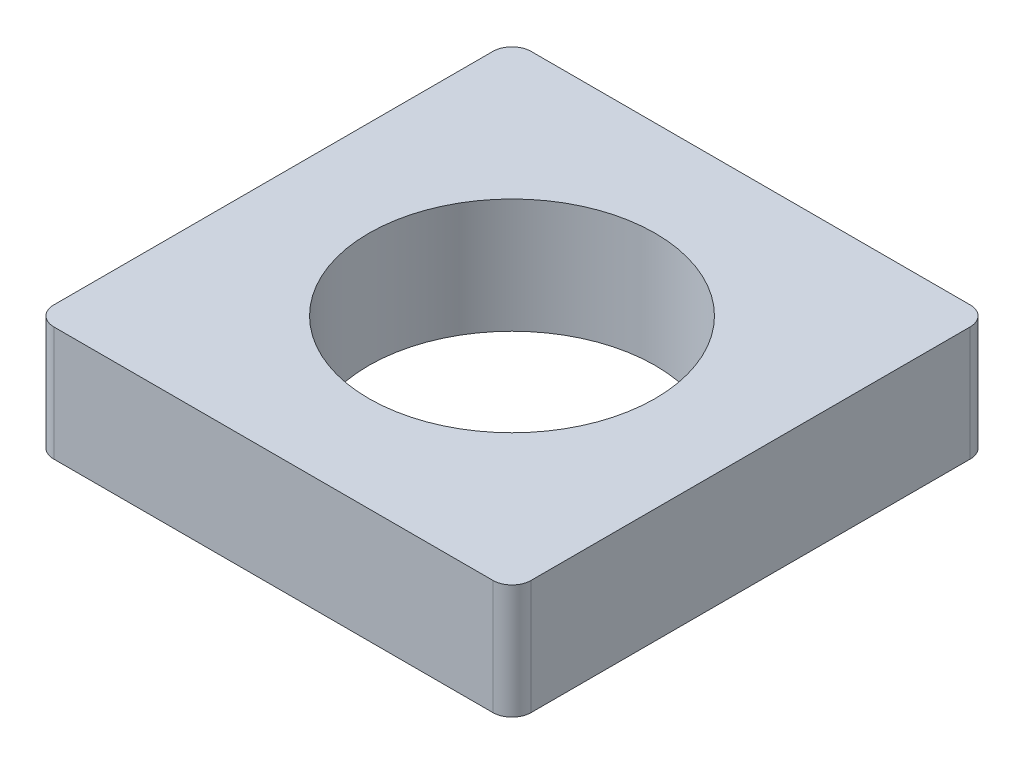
ISO-10303-21;
HEADER;
FILE_DESCRIPTION(('STEP AP214'),'2;1');
FILE_NAME('part.step','',(''),(''),'','','');
FILE_SCHEMA(('AUTOMOTIVE_DESIGN { 1 0 10303 214 1 1 1 1 }'));
ENDSEC;
DATA;
#1=APPLICATION_CONTEXT('core data for automotive mechanical design processes');
#2=APPLICATION_PROTOCOL_DEFINITION('international standard','automotive_design',2000,#1);
#3=PRODUCT_CONTEXT('',#1,'mechanical');
#4=PRODUCT('Part','Part','',(#3));
#5=PRODUCT_RELATED_PRODUCT_CATEGORY('part','',(#4));
#6=PRODUCT_DEFINITION_FORMATION('','',#4);
#7=PRODUCT_DEFINITION_CONTEXT('part definition',#1,'design');
#8=PRODUCT_DEFINITION('design','',#6,#7);
#9=PRODUCT_DEFINITION_SHAPE('','',#8);
#10=(LENGTH_UNIT() NAMED_UNIT(*) SI_UNIT(.MILLI.,.METRE.));
#11=(NAMED_UNIT(*) PLANE_ANGLE_UNIT() SI_UNIT($,.RADIAN.));
#12=(NAMED_UNIT(*) SI_UNIT($,.STERADIAN.) SOLID_ANGLE_UNIT());
#13=UNCERTAINTY_MEASURE_WITH_UNIT(LENGTH_MEASURE(1.E-05),#10,'distance_accuracy_value','');
#14=(GEOMETRIC_REPRESENTATION_CONTEXT(3) GLOBAL_UNCERTAINTY_ASSIGNED_CONTEXT((#13)) GLOBAL_UNIT_ASSIGNED_CONTEXT((#10,
#11,#12)) REPRESENTATION_CONTEXT('',''));
#15=CARTESIAN_POINT('',(0.,0.,0.));
#16=DIRECTION('',(0.,0.,1.));
#17=DIRECTION('',(1.,0.,0.));
#18=AXIS2_PLACEMENT_3D('',#15,#16,#17);
#19=CARTESIAN_POINT('',(58.42,30.48,-58.42));
#20=DIRECTION('',(0.,-1.,0.));
#21=DIRECTION('',(0.,0.,-1.));
#22=AXIS2_PLACEMENT_3D('',#19,#20,#21);
#23=PLANE('',#22);
#24=CARTESIAN_POINT('',(58.42,30.48,-58.42));
#25=DIRECTION('',(0.,1.,0.));
#26=DIRECTION('',(0.,0.,-1.));
#27=AXIS2_PLACEMENT_3D('',#24,#25,#26);
#28=CIRCLE('',#27,5.08);
#29=CARTESIAN_POINT('',(63.5,30.48,-58.42));
#30=VERTEX_POINT('',#29);
#31=CARTESIAN_POINT('',(58.42,30.48,-63.5));
#32=VERTEX_POINT('',#31);
#33=EDGE_CURVE('E147',#30,#32,#28,.T.);
#34=ORIENTED_EDGE('',*,*,#33,.T.);
#35=DIRECTION('',(-1.,0.,0.));
#36=VECTOR('',#35,1.);
#37=CARTESIAN_POINT('',(58.42,30.48,-63.5));
#38=LINE('',#37,#36);
#39=CARTESIAN_POINT('',(-58.42,30.48,-63.5));
#40=VERTEX_POINT('',#39);
#41=EDGE_CURVE('E95',#32,#40,#38,.T.);
#42=ORIENTED_EDGE('',*,*,#41,.T.);
#43=CARTESIAN_POINT('',(-58.42,30.48,-58.42));
#44=DIRECTION('',(0.,1.,0.));
#45=DIRECTION('',(0.,0.,-1.));
#46=AXIS2_PLACEMENT_3D('',#43,#44,#45);
#47=CIRCLE('',#46,5.08);
#48=CARTESIAN_POINT('',(-63.5,30.48,-58.42));
#49=VERTEX_POINT('',#48);
#50=EDGE_CURVE('E162',#40,#49,#47,.T.);
#51=ORIENTED_EDGE('',*,*,#50,.T.);
#52=DIRECTION('',(0.,0.,1.));
#53=VECTOR('',#52,1.);
#54=CARTESIAN_POINT('',(-63.5,30.48,58.42));
#55=LINE('',#54,#53);
#56=CARTESIAN_POINT('',(-63.5,30.48,58.42));
#57=VERTEX_POINT('',#56);
#58=EDGE_CURVE('E175',#49,#57,#55,.T.);
#59=ORIENTED_EDGE('',*,*,#58,.T.);
#60=CARTESIAN_POINT('',(-58.42,30.48,58.42));
#61=DIRECTION('',(0.,1.,0.));
#62=DIRECTION('',(0.,0.,-1.));
#63=AXIS2_PLACEMENT_3D('',#60,#61,#62);
#64=CIRCLE('',#63,5.08);
#65=CARTESIAN_POINT('',(-58.42,30.48,63.5));
#66=VERTEX_POINT('',#65);
#67=EDGE_CURVE('E114',#57,#66,#64,.T.);
#68=ORIENTED_EDGE('',*,*,#67,.T.);
#69=DIRECTION('',(1.,0.,0.));
#70=VECTOR('',#69,1.);
#71=CARTESIAN_POINT('',(58.42,30.48,63.5));
#72=LINE('',#71,#70);
#73=CARTESIAN_POINT('',(58.42,30.48,63.5));
#74=VERTEX_POINT('',#73);
#75=EDGE_CURVE('E108',#66,#74,#72,.T.);
#76=ORIENTED_EDGE('',*,*,#75,.T.);
#77=CARTESIAN_POINT('',(58.42,30.48,58.42));
#78=DIRECTION('',(0.,1.,0.));
#79=DIRECTION('',(0.,0.,-1.));
#80=AXIS2_PLACEMENT_3D('',#77,#78,#79);
#81=CIRCLE('',#80,5.08);
#82=CARTESIAN_POINT('',(63.5,30.48,58.4199999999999));
#83=VERTEX_POINT('',#82);
#84=EDGE_CURVE('E112',#74,#83,#81,.T.);
#85=ORIENTED_EDGE('',*,*,#84,.T.);
#86=DIRECTION('',(0.,0.,-1.));
#87=VECTOR('',#86,1.);
#88=CARTESIAN_POINT('',(63.5,30.48,58.4199999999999));
#89=LINE('',#88,#87);
#90=EDGE_CURVE('E52',#83,#30,#89,.T.);
#91=ORIENTED_EDGE('',*,*,#90,.T.);
#92=EDGE_LOOP('',(#34,#42,#51,#59,#68,#76,#85,#91));
#93=FACE_BOUND('',#92,.T.);
#94=CARTESIAN_POINT('',(0.,30.48,0.));
#95=DIRECTION('',(0.,1.,0.));
#96=DIRECTION('',(0.,0.,1.));
#97=AXIS2_PLACEMENT_3D('',#94,#95,#96);
#98=CIRCLE('',#97,38.1);
#99=CARTESIAN_POINT('',(0.,30.48,-38.1));
#100=VERTEX_POINT('',#99);
#101=EDGE_CURVE('E136',#100,#100,#98,.T.);
#102=ORIENTED_EDGE('',*,*,#101,.F.);
#103=EDGE_LOOP('',(#102));
#104=FACE_BOUND('',#103,.T.);
#105=ADVANCED_FACE('F35',(#93,#104),#23,.F.);
#106=CARTESIAN_POINT('',(58.42,0.,-58.42));
#107=DIRECTION('',(0.,-1.,0.));
#108=DIRECTION('',(0.,0.,-1.));
#109=AXIS2_PLACEMENT_3D('',#106,#107,#108);
#110=PLANE('',#109);
#111=CARTESIAN_POINT('',(41.91,0.,0.));
#112=DIRECTION('',(0.,-1.,0.));
#113=DIRECTION('',(0.,0.,-1.));
#114=AXIS2_PLACEMENT_3D('',#111,#112,#113);
#115=CIRCLE('',#114,2.28599999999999);
#116=CARTESIAN_POINT('',(41.91,0.,-2.28599999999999));
#117=VERTEX_POINT('',#116);
#118=EDGE_CURVE('E187',#117,#117,#115,.T.);
#119=ORIENTED_EDGE('',*,*,#118,.F.);
#120=EDGE_LOOP('',(#119));
#121=FACE_BOUND('',#120,.T.);
#122=CARTESIAN_POINT('',(58.42,0.,-58.42));
#123=DIRECTION('',(0.,1.,0.));
#124=DIRECTION('',(0.,0.,-1.));
#125=AXIS2_PLACEMENT_3D('',#122,#123,#124);
#126=CIRCLE('',#125,5.08);
#127=CARTESIAN_POINT('',(63.5,0.,-58.42));
#128=VERTEX_POINT('',#127);
#129=CARTESIAN_POINT('',(58.42,0.,-63.5));
#130=VERTEX_POINT('',#129);
#131=EDGE_CURVE('E132',#128,#130,#126,.T.);
#132=ORIENTED_EDGE('',*,*,#131,.F.);
#133=DIRECTION('',(0.,0.,-1.));
#134=VECTOR('',#133,1.);
#135=CARTESIAN_POINT('',(63.5,0.,58.4199999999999));
#136=LINE('',#135,#134);
#137=CARTESIAN_POINT('',(63.5,0.,58.4199999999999));
#138=VERTEX_POINT('',#137);
#139=EDGE_CURVE('E87',#138,#128,#136,.T.);
#140=ORIENTED_EDGE('',*,*,#139,.F.);
#141=CARTESIAN_POINT('',(58.42,0.,58.42));
#142=DIRECTION('',(0.,1.,0.));
#143=DIRECTION('',(0.,0.,-1.));
#144=AXIS2_PLACEMENT_3D('',#141,#142,#143);
#145=CIRCLE('',#144,5.08);
#146=CARTESIAN_POINT('',(58.42,0.,63.5));
#147=VERTEX_POINT('',#146);
#148=EDGE_CURVE('E81',#147,#138,#145,.T.);
#149=ORIENTED_EDGE('',*,*,#148,.F.);
#150=DIRECTION('',(1.,0.,0.));
#151=VECTOR('',#150,1.);
#152=CARTESIAN_POINT('',(58.42,0.,63.5));
#153=LINE('',#152,#151);
#154=CARTESIAN_POINT('',(-58.42,0.,63.5));
#155=VERTEX_POINT('',#154);
#156=EDGE_CURVE('E122',#155,#147,#153,.T.);
#157=ORIENTED_EDGE('',*,*,#156,.F.);
#158=CARTESIAN_POINT('',(-58.42,0.,58.42));
#159=DIRECTION('',(0.,1.,0.));
#160=DIRECTION('',(0.,0.,-1.));
#161=AXIS2_PLACEMENT_3D('',#158,#159,#160);
#162=CIRCLE('',#161,5.08);
#163=CARTESIAN_POINT('',(-63.5,0.,58.42));
#164=VERTEX_POINT('',#163);
#165=EDGE_CURVE('E142',#164,#155,#162,.T.);
#166=ORIENTED_EDGE('',*,*,#165,.F.);
#167=DIRECTION('',(0.,0.,1.));
#168=VECTOR('',#167,1.);
#169=CARTESIAN_POINT('',(-63.5,0.,58.42));
#170=LINE('',#169,#168);
#171=CARTESIAN_POINT('',(-63.5,0.,-58.42));
#172=VERTEX_POINT('',#171);
#173=EDGE_CURVE('E140',#172,#164,#170,.T.);
#174=ORIENTED_EDGE('',*,*,#173,.F.);
#175=CARTESIAN_POINT('',(-58.42,0.,-58.42));
#176=DIRECTION('',(0.,1.,0.));
#177=DIRECTION('',(0.,0.,-1.));
#178=AXIS2_PLACEMENT_3D('',#175,#176,#177);
#179=CIRCLE('',#178,5.08);
#180=CARTESIAN_POINT('',(-58.42,0.,-63.5));
#181=VERTEX_POINT('',#180);
#182=EDGE_CURVE('E138',#181,#172,#179,.T.);
#183=ORIENTED_EDGE('',*,*,#182,.F.);
#184=DIRECTION('',(-1.,0.,0.));
#185=VECTOR('',#184,1.);
#186=CARTESIAN_POINT('',(58.42,0.,-63.5));
#187=LINE('',#186,#185);
#188=EDGE_CURVE('E135',#130,#181,#187,.T.);
#189=ORIENTED_EDGE('',*,*,#188,.F.);
#190=EDGE_LOOP('',(#132,#140,#149,#157,#166,#174,#183,#189));
#191=FACE_BOUND('',#190,.T.);
#192=CARTESIAN_POINT('',(0.,0.,0.));
#193=DIRECTION('',(0.,1.,0.));
#194=DIRECTION('',(0.,0.,1.));
#195=AXIS2_PLACEMENT_3D('',#192,#193,#194);
#196=CIRCLE('',#195,38.1);
#197=CARTESIAN_POINT('',(0.,0.,-38.1));
#198=VERTEX_POINT('',#197);
#199=EDGE_CURVE('E181',#198,#198,#196,.T.);
#200=ORIENTED_EDGE('',*,*,#199,.T.);
#201=EDGE_LOOP('',(#200));
#202=FACE_BOUND('',#201,.T.);
#203=ADVANCED_FACE('F166',(#121,#191,#202),#110,.T.);
#204=CARTESIAN_POINT('',(58.42,30.48,-58.42));
#205=DIRECTION('',(0.,-1.,0.));
#206=DIRECTION('',(0.,0.,-1.));
#207=AXIS2_PLACEMENT_3D('',#204,#205,#206);
#208=CYLINDRICAL_SURFACE('',#207,5.08);
#209=ORIENTED_EDGE('',*,*,#131,.T.);
#210=DIRECTION('',(0.,-1.,0.));
#211=VECTOR('',#210,1.);
#212=CARTESIAN_POINT('',(58.42,30.48,-63.5));
#213=LINE('',#212,#211);
#214=EDGE_CURVE('E11',#32,#130,#213,.T.);
#215=ORIENTED_EDGE('',*,*,#214,.F.);
#216=ORIENTED_EDGE('',*,*,#33,.F.);
#217=DIRECTION('',(0.,-1.,0.));
#218=VECTOR('',#217,1.);
#219=CARTESIAN_POINT('',(63.5,30.48,-58.42));
#220=LINE('',#219,#218);
#221=EDGE_CURVE('E128',#30,#128,#220,.T.);
#222=ORIENTED_EDGE('',*,*,#221,.T.);
#223=EDGE_LOOP('',(#209,#215,#216,#222));
#224=FACE_BOUND('',#223,.T.);
#225=ADVANCED_FACE('F37',(#224),#208,.T.);
#226=CARTESIAN_POINT('',(58.42,30.48,-63.5));
#227=DIRECTION('',(0.,0.,1.));
#228=DIRECTION('',(1.,0.,0.));
#229=AXIS2_PLACEMENT_3D('',#226,#227,#228);
#230=PLANE('',#229);
#231=ORIENTED_EDGE('',*,*,#188,.T.);
#232=DIRECTION('',(0.,-1.,0.));
#233=VECTOR('',#232,1.);
#234=CARTESIAN_POINT('',(-58.42,30.48,-63.5));
#235=LINE('',#234,#233);
#236=EDGE_CURVE('E44',#40,#181,#235,.T.);
#237=ORIENTED_EDGE('',*,*,#236,.F.);
#238=ORIENTED_EDGE('',*,*,#41,.F.);
#239=ORIENTED_EDGE('',*,*,#214,.T.);
#240=EDGE_LOOP('',(#231,#237,#238,#239));
#241=FACE_BOUND('',#240,.T.);
#242=ADVANCED_FACE('F208',(#241),#230,.F.);
#243=CARTESIAN_POINT('',(-58.42,30.48,-58.42));
#244=DIRECTION('',(0.,-1.,0.));
#245=DIRECTION('',(0.,0.,-1.));
#246=AXIS2_PLACEMENT_3D('',#243,#244,#245);
#247=CYLINDRICAL_SURFACE('',#246,5.08);
#248=ORIENTED_EDGE('',*,*,#182,.T.);
#249=DIRECTION('',(0.,-1.,0.));
#250=VECTOR('',#249,1.);
#251=CARTESIAN_POINT('',(-63.5,30.48,-58.42));
#252=LINE('',#251,#250);
#253=EDGE_CURVE('E154',#49,#172,#252,.T.);
#254=ORIENTED_EDGE('',*,*,#253,.F.);
#255=ORIENTED_EDGE('',*,*,#50,.F.);
#256=ORIENTED_EDGE('',*,*,#236,.T.);
#257=EDGE_LOOP('',(#248,#254,#255,#256));
#258=FACE_BOUND('',#257,.T.);
#259=ADVANCED_FACE('F160',(#258),#247,.T.);
#260=CARTESIAN_POINT('',(-63.5,30.48,58.42));
#261=DIRECTION('',(1.,0.,0.));
#262=DIRECTION('',(0.,0.,-1.));
#263=AXIS2_PLACEMENT_3D('',#260,#261,#262);
#264=PLANE('',#263);
#265=ORIENTED_EDGE('',*,*,#173,.T.);
#266=DIRECTION('',(0.,-1.,0.));
#267=VECTOR('',#266,1.);
#268=CARTESIAN_POINT('',(-63.5,30.48,58.42));
#269=LINE('',#268,#267);
#270=EDGE_CURVE('E151',#57,#164,#269,.T.);
#271=ORIENTED_EDGE('',*,*,#270,.F.);
#272=ORIENTED_EDGE('',*,*,#58,.F.);
#273=ORIENTED_EDGE('',*,*,#253,.T.);
#274=EDGE_LOOP('',(#265,#271,#272,#273));
#275=FACE_BOUND('',#274,.T.);
#276=ADVANCED_FACE('F171',(#275),#264,.F.);
#277=CARTESIAN_POINT('',(-58.42,30.48,58.42));
#278=DIRECTION('',(0.,-1.,0.));
#279=DIRECTION('',(0.,0.,-1.));
#280=AXIS2_PLACEMENT_3D('',#277,#278,#279);
#281=CYLINDRICAL_SURFACE('',#280,5.08);
#282=ORIENTED_EDGE('',*,*,#165,.T.);
#283=DIRECTION('',(0.,-1.,0.));
#284=VECTOR('',#283,1.);
#285=CARTESIAN_POINT('',(-58.42,30.48,63.5));
#286=LINE('',#285,#284);
#287=EDGE_CURVE('E123',#66,#155,#286,.T.);
#288=ORIENTED_EDGE('',*,*,#287,.F.);
#289=ORIENTED_EDGE('',*,*,#67,.F.);
#290=ORIENTED_EDGE('',*,*,#270,.T.);
#291=EDGE_LOOP('',(#282,#288,#289,#290));
#292=FACE_BOUND('',#291,.T.);
#293=ADVANCED_FACE('F174',(#292),#281,.T.);
#294=CARTESIAN_POINT('',(58.42,30.48,63.5));
#295=DIRECTION('',(0.,0.,-1.));
#296=DIRECTION('',(-1.,0.,0.));
#297=AXIS2_PLACEMENT_3D('',#294,#295,#296);
#298=PLANE('',#297);
#299=ORIENTED_EDGE('',*,*,#156,.T.);
#300=DIRECTION('',(0.,-1.,0.));
#301=VECTOR('',#300,1.);
#302=CARTESIAN_POINT('',(58.42,30.48,63.5));
#303=LINE('',#302,#301);
#304=EDGE_CURVE('E119',#74,#147,#303,.T.);
#305=ORIENTED_EDGE('',*,*,#304,.F.);
#306=ORIENTED_EDGE('',*,*,#75,.F.);
#307=ORIENTED_EDGE('',*,*,#287,.T.);
#308=EDGE_LOOP('',(#299,#305,#306,#307));
#309=FACE_BOUND('',#308,.T.);
#310=ADVANCED_FACE('F120',(#309),#298,.F.);
#311=CARTESIAN_POINT('',(58.42,30.48,58.42));
#312=DIRECTION('',(0.,-1.,0.));
#313=DIRECTION('',(0.,0.,-1.));
#314=AXIS2_PLACEMENT_3D('',#311,#312,#313);
#315=CYLINDRICAL_SURFACE('',#314,5.08);
#316=ORIENTED_EDGE('',*,*,#148,.T.);
#317=DIRECTION('',(0.,-1.,0.));
#318=VECTOR('',#317,1.);
#319=CARTESIAN_POINT('',(63.5,30.48,58.4199999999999));
#320=LINE('',#319,#318);
#321=EDGE_CURVE('E124',#83,#138,#320,.T.);
#322=ORIENTED_EDGE('',*,*,#321,.F.);
#323=ORIENTED_EDGE('',*,*,#84,.F.);
#324=ORIENTED_EDGE('',*,*,#304,.T.);
#325=EDGE_LOOP('',(#316,#322,#323,#324));
#326=FACE_BOUND('',#325,.T.);
#327=ADVANCED_FACE('F126',(#326),#315,.T.);
#328=CARTESIAN_POINT('',(63.5,30.48,58.4199999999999));
#329=DIRECTION('',(-1.,0.,0.));
#330=DIRECTION('',(0.,0.,1.));
#331=AXIS2_PLACEMENT_3D('',#328,#329,#330);
#332=PLANE('',#331);
#333=ORIENTED_EDGE('',*,*,#139,.T.);
#334=ORIENTED_EDGE('',*,*,#221,.F.);
#335=ORIENTED_EDGE('',*,*,#90,.F.);
#336=ORIENTED_EDGE('',*,*,#321,.T.);
#337=EDGE_LOOP('',(#333,#334,#335,#336));
#338=FACE_BOUND('',#337,.T.);
#339=ADVANCED_FACE('F213',(#338),#332,.F.);
#340=CARTESIAN_POINT('',(0.,30.48,0.));
#341=DIRECTION('',(0.,-1.,0.));
#342=DIRECTION('',(0.,0.,-1.));
#343=AXIS2_PLACEMENT_3D('',#340,#341,#342);
#344=CYLINDRICAL_SURFACE('',#343,38.1);
#345=CARTESIAN_POINT('',(0.,30.48,-38.1));
#346=CARTESIAN_POINT('',(0.,30.1625,-38.1));
#347=CARTESIAN_POINT('',(0.,29.845,-38.1));
#348=CARTESIAN_POINT('',(0.,29.21,-38.1));
#349=CARTESIAN_POINT('',(0.,28.8925,-38.1));
#350=CARTESIAN_POINT('',(0.,28.2575,-38.1));
#351=CARTESIAN_POINT('',(0.,27.94,-38.1));
#352=CARTESIAN_POINT('',(0.,27.305,-38.1));
#353=CARTESIAN_POINT('',(0.,26.9875,-38.1));
#354=CARTESIAN_POINT('',(0.,26.3525,-38.1));
#355=CARTESIAN_POINT('',(0.,26.035,-38.1));
#356=CARTESIAN_POINT('',(0.,25.4,-38.1));
#357=CARTESIAN_POINT('',(0.,25.0825,-38.1));
#358=CARTESIAN_POINT('',(0.,24.4475,-38.1));
#359=CARTESIAN_POINT('',(0.,24.13,-38.1));
#360=CARTESIAN_POINT('',(0.,23.495,-38.1));
#361=CARTESIAN_POINT('',(0.,23.1775,-38.1));
#362=CARTESIAN_POINT('',(0.,22.5425,-38.1));
#363=CARTESIAN_POINT('',(0.,22.225,-38.1));
#364=CARTESIAN_POINT('',(0.,21.59,-38.1));
#365=CARTESIAN_POINT('',(0.,21.2725,-38.1));
#366=CARTESIAN_POINT('',(0.,20.6375,-38.1));
#367=CARTESIAN_POINT('',(0.,20.32,-38.1));
#368=CARTESIAN_POINT('',(0.,19.685,-38.1));
#369=CARTESIAN_POINT('',(0.,19.3675,-38.1));
#370=CARTESIAN_POINT('',(0.,18.7325,-38.1));
#371=CARTESIAN_POINT('',(0.,18.415,-38.1));
#372=CARTESIAN_POINT('',(0.,17.78,-38.1));
#373=CARTESIAN_POINT('',(0.,17.4625,-38.1));
#374=CARTESIAN_POINT('',(0.,16.8275,-38.1));
#375=CARTESIAN_POINT('',(0.,16.51,-38.1));
#376=CARTESIAN_POINT('',(0.,15.875,-38.1));
#377=CARTESIAN_POINT('',(0.,15.5575,-38.1));
#378=CARTESIAN_POINT('',(0.,14.9225,-38.1));
#379=CARTESIAN_POINT('',(0.,14.605,-38.1));
#380=CARTESIAN_POINT('',(0.,13.97,-38.1));
#381=CARTESIAN_POINT('',(0.,13.6525,-38.1));
#382=CARTESIAN_POINT('',(0.,13.0175,-38.1));
#383=CARTESIAN_POINT('',(0.,12.7,-38.1));
#384=CARTESIAN_POINT('',(0.,12.065,-38.1));
#385=CARTESIAN_POINT('',(0.,11.7475,-38.1));
#386=CARTESIAN_POINT('',(0.,11.1125,-38.1));
#387=CARTESIAN_POINT('',(0.,10.795,-38.1));
#388=CARTESIAN_POINT('',(0.,10.16,-38.1));
#389=CARTESIAN_POINT('',(0.,9.8425,-38.1));
#390=CARTESIAN_POINT('',(0.,9.2075,-38.1));
#391=CARTESIAN_POINT('',(0.,8.89,-38.1));
#392=CARTESIAN_POINT('',(0.,8.255,-38.1));
#393=CARTESIAN_POINT('',(0.,7.9375,-38.1));
#394=CARTESIAN_POINT('',(0.,7.3025,-38.1));
#395=CARTESIAN_POINT('',(0.,6.985,-38.1));
#396=CARTESIAN_POINT('',(0.,6.35,-38.1));
#397=CARTESIAN_POINT('',(0.,6.0325,-38.1));
#398=CARTESIAN_POINT('',(0.,5.3975,-38.1));
#399=CARTESIAN_POINT('',(0.,5.08,-38.1));
#400=CARTESIAN_POINT('',(0.,4.445,-38.1));
#401=CARTESIAN_POINT('',(0.,4.1275,-38.1));
#402=CARTESIAN_POINT('',(0.,3.4925,-38.1));
#403=CARTESIAN_POINT('',(0.,3.175,-38.1));
#404=CARTESIAN_POINT('',(0.,2.54,-38.1));
#405=CARTESIAN_POINT('',(0.,2.2225,-38.1));
#406=CARTESIAN_POINT('',(0.,1.5875,-38.1));
#407=CARTESIAN_POINT('',(0.,1.27,-38.1));
#408=CARTESIAN_POINT('',(0.,0.634999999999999,-38.1));
#409=CARTESIAN_POINT('',(0.,0.3175,-38.1));
#410=CARTESIAN_POINT('',(0.,0.,-38.1));
#411=B_SPLINE_CURVE_WITH_KNOTS('',3,(#345,#346,#347,#348,#349,#350,#351,#352,#353,#354,#355,
#356,#357,#358,#359,#360,#361,#362,#363,#364,#365,#366,#367,#368,#369,#370,#371,#372,#373,#374,
#375,#376,#377,#378,#379,#380,#381,#382,#383,#384,#385,#386,#387,#388,#389,#390,#391,#392,#393,
#394,#395,#396,#397,#398,#399,#400,#401,#402,#403,#404,#405,#406,#407,#408,#409,#410),
.UNSPECIFIED.,.F.,.F.,(4,2,2,2,2,2,2,2,2,2,2,2,2,2,2,2,2,2,2,2,2,2,2,2,2,2,2,2,2,2,2,2,4),(0.,
0.952499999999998,1.905,2.8575,3.81,4.7625,5.715,6.6675,7.61999999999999,8.5725,9.525,10.4775,
11.43,12.3825,13.335,14.2875,15.24,16.1925,17.145,18.0975,19.05,20.0025,20.955,21.9075,22.86,
23.8125,24.765,25.7175,26.67,27.6225,28.575,29.5275,30.48),.UNSPECIFIED.);
#412=EDGE_CURVE('BSEAM198',#100,#198,#411,.T.);
#413=ORIENTED_EDGE('',*,*,#101,.T.);
#414=ORIENTED_EDGE('',*,*,#199,.F.);
#415=ORIENTED_EDGE('',*,*,#412,.T.);
#416=ORIENTED_EDGE('',*,*,#412,.F.);
#417=EDGE_LOOP('',(#413,#415,#414,#416));
#418=FACE_BOUND('',#417,.T.);
#419=ADVANCED_FACE('F198',(#418),#344,.F.);
#420=CARTESIAN_POINT('',(41.91,10.16,0.));
#421=DIRECTION('',(0.,-1.,0.));
#422=DIRECTION('',(0.,0.,-1.));
#423=AXIS2_PLACEMENT_3D('',#420,#421,#422);
#424=CYLINDRICAL_SURFACE('',#423,2.28599999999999);
#425=CARTESIAN_POINT('',(41.91,10.16,0.));
#426=DIRECTION('',(0.,-1.,0.));
#427=DIRECTION('',(0.,0.,-1.));
#428=AXIS2_PLACEMENT_3D('',#425,#426,#427);
#429=CIRCLE('',#428,2.28599999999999);
#430=CARTESIAN_POINT('',(41.91,10.16,-2.28599999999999));
#431=VERTEX_POINT('',#430);
#432=EDGE_CURVE('E184',#431,#431,#429,.T.);
#433=ORIENTED_EDGE('',*,*,#432,.F.);
#434=EDGE_LOOP('',(#433));
#435=FACE_BOUND('',#434,.T.);
#436=ORIENTED_EDGE('',*,*,#118,.T.);
#437=EDGE_LOOP('',(#436));
#438=FACE_BOUND('',#437,.T.);
#439=ADVANCED_FACE('F195',(#435,#438),#424,.F.);
#440=CARTESIAN_POINT('',(41.91,10.16,0.));
#441=DIRECTION('',(0.,-1.,0.));
#442=DIRECTION('',(0.,0.,-1.));
#443=AXIS2_PLACEMENT_3D('',#440,#441,#442);
#444=PLANE('',#443);
#445=ORIENTED_EDGE('',*,*,#432,.T.);
#446=EDGE_LOOP('',(#445));
#447=FACE_BOUND('',#446,.T.);
#448=ADVANCED_FACE('F193',(#447),#444,.T.);
#449=CLOSED_SHELL('',(#105,#203,#225,#242,#259,#276,#293,#310,#327,#339,#419,#439,#448));
#450=MANIFOLD_SOLID_BREP('B2',#449);
#451=ADVANCED_BREP_SHAPE_REPRESENTATION('',(#18,#450),#14);
#452=SHAPE_DEFINITION_REPRESENTATION(#9,#451);
ENDSEC;
END-ISO-10303-21;
